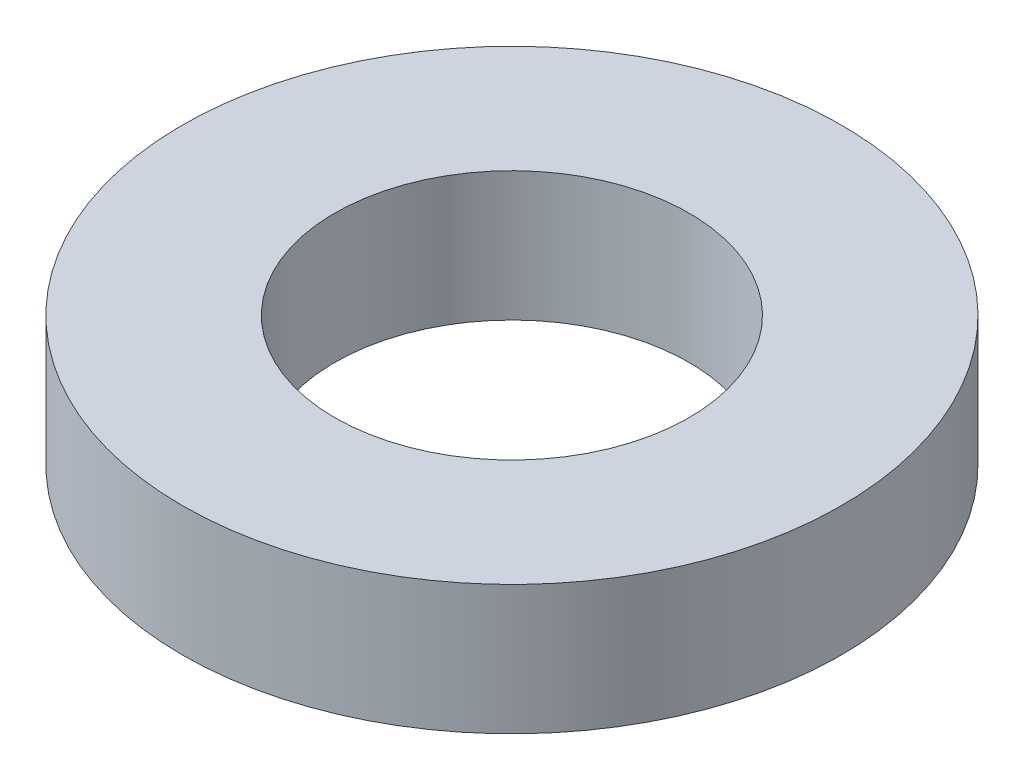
from build123d import *

# Parameters (mm, degrees)
SKETCH1_R      = 4.7244
SKETCH1_R_2    = 2.54
EXTRUDE1_DEPTH = 1.8542


with BuildPart() as part:
    # Sketch1 → Extrude1 (new body)
    with BuildSketch(Plane(origin=(0, 0, 0), x_dir=(1, 0, 0), z_dir=(0, 1, 0))):
        with Locations(Location((0, 0, 0), (0, 0, 270))):
            Circle(SKETCH1_R)
        with Locations(Location((0, 0, 0), (0, 0, 270))):
            Circle(SKETCH1_R_2, mode=Mode.SUBTRACT)
    extrude(amount=EXTRUDE1_DEPTH)


solid = part.part
